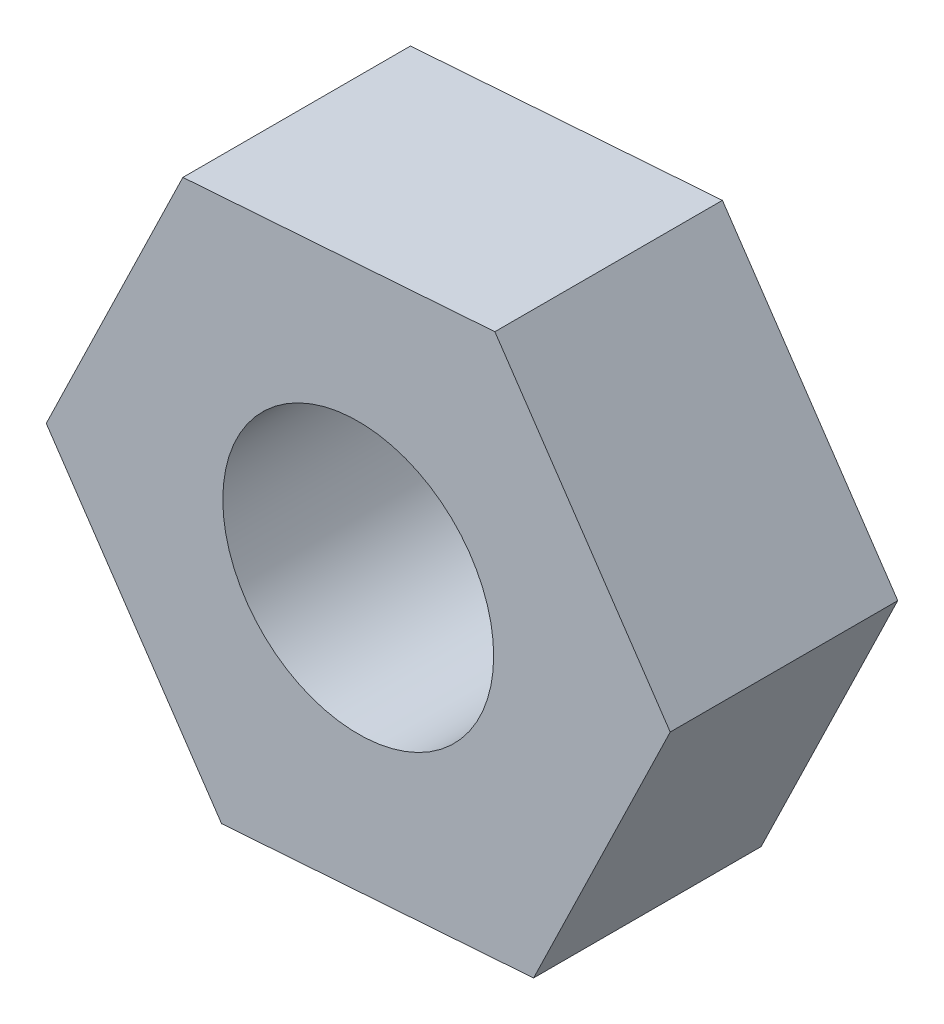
ISO-10303-21;
HEADER;
FILE_DESCRIPTION(('STEP AP214'),'2;1');
FILE_NAME('part.step','',(''),(''),'','','');
FILE_SCHEMA(('AUTOMOTIVE_DESIGN { 1 0 10303 214 1 1 1 1 }'));
ENDSEC;
DATA;
#1=APPLICATION_CONTEXT('core data for automotive mechanical design processes');
#2=APPLICATION_PROTOCOL_DEFINITION('international standard','automotive_design',2000,#1);
#3=PRODUCT_CONTEXT('',#1,'mechanical');
#4=PRODUCT('Part','Part','',(#3));
#5=PRODUCT_RELATED_PRODUCT_CATEGORY('part','',(#4));
#6=PRODUCT_DEFINITION_FORMATION('','',#4);
#7=PRODUCT_DEFINITION_CONTEXT('part definition',#1,'design');
#8=PRODUCT_DEFINITION('design','',#6,#7);
#9=PRODUCT_DEFINITION_SHAPE('','',#8);
#10=(LENGTH_UNIT() NAMED_UNIT(*) SI_UNIT(.MILLI.,.METRE.));
#11=(NAMED_UNIT(*) PLANE_ANGLE_UNIT() SI_UNIT($,.RADIAN.));
#12=(NAMED_UNIT(*) SI_UNIT($,.STERADIAN.) SOLID_ANGLE_UNIT());
#13=UNCERTAINTY_MEASURE_WITH_UNIT(LENGTH_MEASURE(1.E-05),#10,'distance_accuracy_value','');
#14=(GEOMETRIC_REPRESENTATION_CONTEXT(3) GLOBAL_UNCERTAINTY_ASSIGNED_CONTEXT((#13)) GLOBAL_UNIT_ASSIGNED_CONTEXT((#10,
#11,#12)) REPRESENTATION_CONTEXT('',''));
#15=CARTESIAN_POINT('',(0.,0.,0.));
#16=DIRECTION('',(0.,0.,1.));
#17=DIRECTION('',(1.,0.,0.));
#18=AXIS2_PLACEMENT_3D('',#15,#16,#17);
#19=CARTESIAN_POINT('',(-6.04670451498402,-5.45305025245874,0.));
#20=DIRECTION('',(0.,0.,-1.));
#21=DIRECTION('',(-1.,0.,0.));
#22=AXIS2_PLACEMENT_3D('',#19,#20,#21);
#23=PLANE('',#22);
#24=DIRECTION('',(0.560566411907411,-0.828109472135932,0.));
#25=VECTOR('',#24,1.);
#26=CARTESIAN_POINT('',(-2.44141895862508,-5.31290810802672,0.));
#27=LINE('',#26,#25);
#28=CARTESIAN_POINT('',(-5.75876320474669,-0.412285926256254,0.));
#29=VERTEX_POINT('',#28);
#30=CARTESIAN_POINT('',(-2.52233151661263,-5.19337819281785,0.));
#31=VERTEX_POINT('',#30);
#32=EDGE_CURVE('E66',#29,#31,#27,.T.);
#33=ORIENTED_EDGE('',*,*,#32,.F.);
#34=DIRECTION('',(-0.436880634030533,-0.899519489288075,0.));
#35=VECTOR('',#34,1.);
#36=CARTESIAN_POINT('',(-5.821822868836,-0.542123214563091,0.));
#37=LINE('',#36,#35);
#38=CARTESIAN_POINT('',(-3.23643168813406,4.78109226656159,0.));
#39=VERTEX_POINT('',#38);
#40=EDGE_CURVE('E71',#39,#29,#37,.T.);
#41=ORIENTED_EDGE('',*,*,#40,.F.);
#42=DIRECTION('',(-0.997447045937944,-0.0714100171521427,0.));
#43=VECTOR('',#42,1.);
#44=CARTESIAN_POINT('',(-3.38040391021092,4.77078489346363,0.));
#45=LINE('',#44,#43);
#46=CARTESIAN_POINT('',(2.52233151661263,5.19337819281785,0.));
#47=VERTEX_POINT('',#46);
#48=EDGE_CURVE('E96',#47,#39,#45,.T.);
#49=ORIENTED_EDGE('',*,*,#48,.F.);
#50=DIRECTION('',(-0.560566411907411,0.828109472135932,0.));
#51=VECTOR('',#50,1.);
#52=CARTESIAN_POINT('',(2.44141895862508,5.31290810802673,0.));
#53=LINE('',#52,#51);
#54=CARTESIAN_POINT('',(5.75876320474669,0.412285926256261,0.));
#55=VERTEX_POINT('',#54);
#56=EDGE_CURVE('E106',#55,#47,#53,.T.);
#57=ORIENTED_EDGE('',*,*,#56,.F.);
#58=DIRECTION('',(0.436880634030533,0.899519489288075,0.));
#59=VECTOR('',#58,1.);
#60=CARTESIAN_POINT('',(5.821822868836,0.542123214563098,0.));
#61=LINE('',#60,#59);
#62=CARTESIAN_POINT('',(3.23643168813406,-4.78109226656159,0.));
#63=VERTEX_POINT('',#62);
#64=EDGE_CURVE('E111',#63,#55,#61,.T.);
#65=ORIENTED_EDGE('',*,*,#64,.F.);
#66=DIRECTION('',(0.997447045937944,0.071410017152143,0.));
#67=VECTOR('',#66,1.);
#68=CARTESIAN_POINT('',(3.38040391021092,-4.77078489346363,0.));
#69=LINE('',#68,#67);
#70=EDGE_CURVE('E83',#31,#63,#69,.T.);
#71=ORIENTED_EDGE('',*,*,#70,.F.);
#72=EDGE_LOOP('',(#33,#41,#49,#57,#65,#71));
#73=FACE_BOUND('',#72,.T.);
#74=CARTESIAN_POINT('',(0.,0.,0.));
#75=DIRECTION('',(0.,0.,1.));
#76=DIRECTION('',(1.,0.,0.));
#77=AXIS2_PLACEMENT_3D('',#74,#75,#76);
#78=CIRCLE('',#77,2.5);
#79=CARTESIAN_POINT('',(2.5,0.,0.));
#80=VERTEX_POINT('',#79);
#81=EDGE_CURVE('E19',#80,#80,#78,.T.);
#82=ORIENTED_EDGE('',*,*,#81,.T.);
#83=EDGE_LOOP('',(#82));
#84=FACE_BOUND('',#83,.T.);
#85=ADVANCED_FACE('F16',(#73,#84),#23,.T.);
#86=CARTESIAN_POINT('',(0.,0.,-0.105003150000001));
#87=DIRECTION('',(0.,0.,1.));
#88=DIRECTION('',(1.,0.,0.));
#89=AXIS2_PLACEMENT_3D('',#86,#87,#88);
#90=CYLINDRICAL_SURFACE('',#89,2.5);
#91=CARTESIAN_POINT('',(0.,0.,4.2));
#92=DIRECTION('',(0.,0.,1.));
#93=DIRECTION('',(1.,0.,0.));
#94=AXIS2_PLACEMENT_3D('',#91,#92,#93);
#95=CIRCLE('',#94,2.5);
#96=CARTESIAN_POINT('',(2.5,0.,4.2));
#97=VERTEX_POINT('',#96);
#98=EDGE_CURVE('E93',#97,#97,#95,.F.);
#99=ORIENTED_EDGE('',*,*,#98,.F.);
#100=EDGE_LOOP('',(#99));
#101=FACE_BOUND('',#100,.T.);
#102=ORIENTED_EDGE('',*,*,#81,.F.);
#103=EDGE_LOOP('',(#102));
#104=FACE_BOUND('',#103,.T.);
#105=ADVANCED_FACE('F153',(#101,#104),#90,.F.);
#106=CARTESIAN_POINT('',(-5.821822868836,-0.542123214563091,-0.105003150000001));
#107=DIRECTION('',(-0.899519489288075,0.436880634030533,0.));
#108=DIRECTION('',(-0.436880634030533,-0.899519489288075,0.));
#109=AXIS2_PLACEMENT_3D('',#106,#107,#108);
#110=PLANE('',#109);
#111=DIRECTION('',(0.,0.,1.));
#112=VECTOR('',#111,1.);
#113=CARTESIAN_POINT('',(-3.23643168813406,4.78109226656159,-0.105003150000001));
#114=LINE('',#113,#112);
#115=CARTESIAN_POINT('',(-3.23643168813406,4.78109226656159,4.2));
#116=VERTEX_POINT('',#115);
#117=EDGE_CURVE('E76',#39,#116,#114,.T.);
#118=ORIENTED_EDGE('',*,*,#117,.F.);
#119=ORIENTED_EDGE('',*,*,#40,.T.);
#120=DIRECTION('',(0.,0.,1.));
#121=VECTOR('',#120,1.);
#122=CARTESIAN_POINT('',(-5.75876320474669,-0.412285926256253,-0.105003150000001));
#123=LINE('',#122,#121);
#124=CARTESIAN_POINT('',(-5.75876320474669,-0.412285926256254,4.2));
#125=VERTEX_POINT('',#124);
#126=EDGE_CURVE('E73',#125,#29,#123,.F.);
#127=ORIENTED_EDGE('',*,*,#126,.F.);
#128=DIRECTION('',(-0.436880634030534,-0.899519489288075,0.));
#129=VECTOR('',#128,1.);
#130=CARTESIAN_POINT('',(-3.23643168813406,4.78109226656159,4.2));
#131=LINE('',#130,#129);
#132=EDGE_CURVE('E95',#116,#125,#131,.T.);
#133=ORIENTED_EDGE('',*,*,#132,.F.);
#134=EDGE_LOOP('',(#118,#119,#127,#133));
#135=FACE_BOUND('',#134,.T.);
#136=ADVANCED_FACE('F72',(#135),#110,.T.);
#137=CARTESIAN_POINT('',(-2.44141895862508,-5.31290810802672,-0.105003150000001));
#138=DIRECTION('',(-0.828109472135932,-0.560566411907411,0.));
#139=DIRECTION('',(0.560566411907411,-0.828109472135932,0.));
#140=AXIS2_PLACEMENT_3D('',#137,#138,#139);
#141=PLANE('',#140);
#142=ORIENTED_EDGE('',*,*,#126,.T.);
#143=ORIENTED_EDGE('',*,*,#32,.T.);
#144=DIRECTION('',(0.,0.,1.));
#145=VECTOR('',#144,1.);
#146=CARTESIAN_POINT('',(-2.52233151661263,-5.19337819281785,-0.105003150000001));
#147=LINE('',#146,#145);
#148=CARTESIAN_POINT('',(-2.52233151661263,-5.19337819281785,4.2));
#149=VERTEX_POINT('',#148);
#150=EDGE_CURVE('E85',#149,#31,#147,.F.);
#151=ORIENTED_EDGE('',*,*,#150,.F.);
#152=DIRECTION('',(0.56056641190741,-0.828109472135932,0.));
#153=VECTOR('',#152,1.);
#154=CARTESIAN_POINT('',(-5.75876320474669,-0.412285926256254,4.2));
#155=LINE('',#154,#153);
#156=EDGE_CURVE('E89',#125,#149,#155,.T.);
#157=ORIENTED_EDGE('',*,*,#156,.F.);
#158=EDGE_LOOP('',(#142,#143,#151,#157));
#159=FACE_BOUND('',#158,.T.);
#160=ADVANCED_FACE('F87',(#159),#141,.T.);
#161=CARTESIAN_POINT('',(3.38040391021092,-4.77078489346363,-0.105003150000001));
#162=DIRECTION('',(0.071410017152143,-0.997447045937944,0.));
#163=DIRECTION('',(0.997447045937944,0.071410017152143,0.));
#164=AXIS2_PLACEMENT_3D('',#161,#162,#163);
#165=PLANE('',#164);
#166=ORIENTED_EDGE('',*,*,#150,.T.);
#167=ORIENTED_EDGE('',*,*,#70,.T.);
#168=DIRECTION('',(0.,0.,1.));
#169=VECTOR('',#168,1.);
#170=CARTESIAN_POINT('',(3.23643168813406,-4.78109226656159,-0.105003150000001));
#171=LINE('',#170,#169);
#172=CARTESIAN_POINT('',(3.23643168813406,-4.78109226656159,4.2));
#173=VERTEX_POINT('',#172);
#174=EDGE_CURVE('E113',#173,#63,#171,.F.);
#175=ORIENTED_EDGE('',*,*,#174,.F.);
#176=DIRECTION('',(0.997447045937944,0.0714100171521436,0.));
#177=VECTOR('',#176,1.);
#178=CARTESIAN_POINT('',(-2.52233151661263,-5.19337819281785,4.2));
#179=LINE('',#178,#177);
#180=EDGE_CURVE('E120',#149,#173,#179,.T.);
#181=ORIENTED_EDGE('',*,*,#180,.F.);
#182=EDGE_LOOP('',(#166,#167,#175,#181));
#183=FACE_BOUND('',#182,.T.);
#184=ADVANCED_FACE('F118',(#183),#165,.T.);
#185=CARTESIAN_POINT('',(5.821822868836,0.542123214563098,-0.105003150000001));
#186=DIRECTION('',(0.899519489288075,-0.436880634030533,0.));
#187=DIRECTION('',(0.436880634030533,0.899519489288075,0.));
#188=AXIS2_PLACEMENT_3D('',#185,#186,#187);
#189=PLANE('',#188);
#190=ORIENTED_EDGE('',*,*,#174,.T.);
#191=ORIENTED_EDGE('',*,*,#64,.T.);
#192=DIRECTION('',(0.,0.,1.));
#193=VECTOR('',#192,1.);
#194=CARTESIAN_POINT('',(5.75876320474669,0.412285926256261,-0.105003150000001));
#195=LINE('',#194,#193);
#196=CARTESIAN_POINT('',(5.75876320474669,0.412285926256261,4.2));
#197=VERTEX_POINT('',#196);
#198=EDGE_CURVE('E108',#197,#55,#195,.F.);
#199=ORIENTED_EDGE('',*,*,#198,.F.);
#200=DIRECTION('',(0.436880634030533,0.899519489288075,0.));
#201=VECTOR('',#200,1.);
#202=CARTESIAN_POINT('',(3.23643168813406,-4.78109226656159,4.2));
#203=LINE('',#202,#201);
#204=EDGE_CURVE('E124',#173,#197,#203,.T.);
#205=ORIENTED_EDGE('',*,*,#204,.F.);
#206=EDGE_LOOP('',(#190,#191,#199,#205));
#207=FACE_BOUND('',#206,.T.);
#208=ADVANCED_FACE('F133',(#207),#189,.T.);
#209=CARTESIAN_POINT('',(2.44141895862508,5.31290810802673,-0.105003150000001));
#210=DIRECTION('',(0.828109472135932,0.560566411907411,0.));
#211=DIRECTION('',(-0.560566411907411,0.828109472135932,0.));
#212=AXIS2_PLACEMENT_3D('',#209,#210,#211);
#213=PLANE('',#212);
#214=ORIENTED_EDGE('',*,*,#198,.T.);
#215=ORIENTED_EDGE('',*,*,#56,.T.);
#216=DIRECTION('',(0.,0.,1.));
#217=VECTOR('',#216,1.);
#218=CARTESIAN_POINT('',(2.52233151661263,5.19337819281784,-0.105003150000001));
#219=LINE('',#218,#217);
#220=CARTESIAN_POINT('',(2.52233151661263,5.19337819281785,4.2));
#221=VERTEX_POINT('',#220);
#222=EDGE_CURVE('E34',#221,#47,#219,.F.);
#223=ORIENTED_EDGE('',*,*,#222,.F.);
#224=DIRECTION('',(-0.560566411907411,0.828109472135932,0.));
#225=VECTOR('',#224,1.);
#226=CARTESIAN_POINT('',(5.75876320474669,0.412285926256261,4.2));
#227=LINE('',#226,#225);
#228=EDGE_CURVE('E25',#197,#221,#227,.T.);
#229=ORIENTED_EDGE('',*,*,#228,.F.);
#230=EDGE_LOOP('',(#214,#215,#223,#229));
#231=FACE_BOUND('',#230,.T.);
#232=ADVANCED_FACE('F130',(#231),#213,.T.);
#233=CARTESIAN_POINT('',(-3.38040391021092,4.77078489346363,-0.105003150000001));
#234=DIRECTION('',(-0.0714100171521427,0.997447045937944,0.));
#235=DIRECTION('',(-0.997447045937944,-0.0714100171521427,0.));
#236=AXIS2_PLACEMENT_3D('',#233,#234,#235);
#237=PLANE('',#236);
#238=ORIENTED_EDGE('',*,*,#222,.T.);
#239=ORIENTED_EDGE('',*,*,#48,.T.);
#240=ORIENTED_EDGE('',*,*,#117,.T.);
#241=DIRECTION('',(-0.997447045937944,-0.0714100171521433,0.));
#242=VECTOR('',#241,1.);
#243=CARTESIAN_POINT('',(2.52233151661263,5.19337819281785,4.2));
#244=LINE('',#243,#242);
#245=EDGE_CURVE('E11',#221,#116,#244,.T.);
#246=ORIENTED_EDGE('',*,*,#245,.F.);
#247=EDGE_LOOP('',(#238,#239,#240,#246));
#248=FACE_BOUND('',#247,.T.);
#249=ADVANCED_FACE('F134',(#248),#237,.T.);
#250=CARTESIAN_POINT('',(-6.04670451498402,-5.45305025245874,4.2));
#251=DIRECTION('',(0.,0.,1.));
#252=DIRECTION('',(1.,0.,0.));
#253=AXIS2_PLACEMENT_3D('',#250,#251,#252);
#254=PLANE('',#253);
#255=ORIENTED_EDGE('',*,*,#228,.T.);
#256=ORIENTED_EDGE('',*,*,#245,.T.);
#257=ORIENTED_EDGE('',*,*,#132,.T.);
#258=ORIENTED_EDGE('',*,*,#156,.T.);
#259=ORIENTED_EDGE('',*,*,#180,.T.);
#260=ORIENTED_EDGE('',*,*,#204,.T.);
#261=EDGE_LOOP('',(#255,#256,#257,#258,#259,#260));
#262=FACE_BOUND('',#261,.T.);
#263=ORIENTED_EDGE('',*,*,#98,.T.);
#264=EDGE_LOOP('',(#263));
#265=FACE_BOUND('',#264,.T.);
#266=ADVANCED_FACE('F127',(#262,#265),#254,.T.);
#267=CLOSED_SHELL('',(#85,#105,#136,#160,#184,#208,#232,#249,#266));
#268=MANIFOLD_SOLID_BREP('B1',#267);
#269=ADVANCED_BREP_SHAPE_REPRESENTATION('',(#18,#268),#14);
#270=SHAPE_DEFINITION_REPRESENTATION(#9,#269);
ENDSEC;
END-ISO-10303-21;
